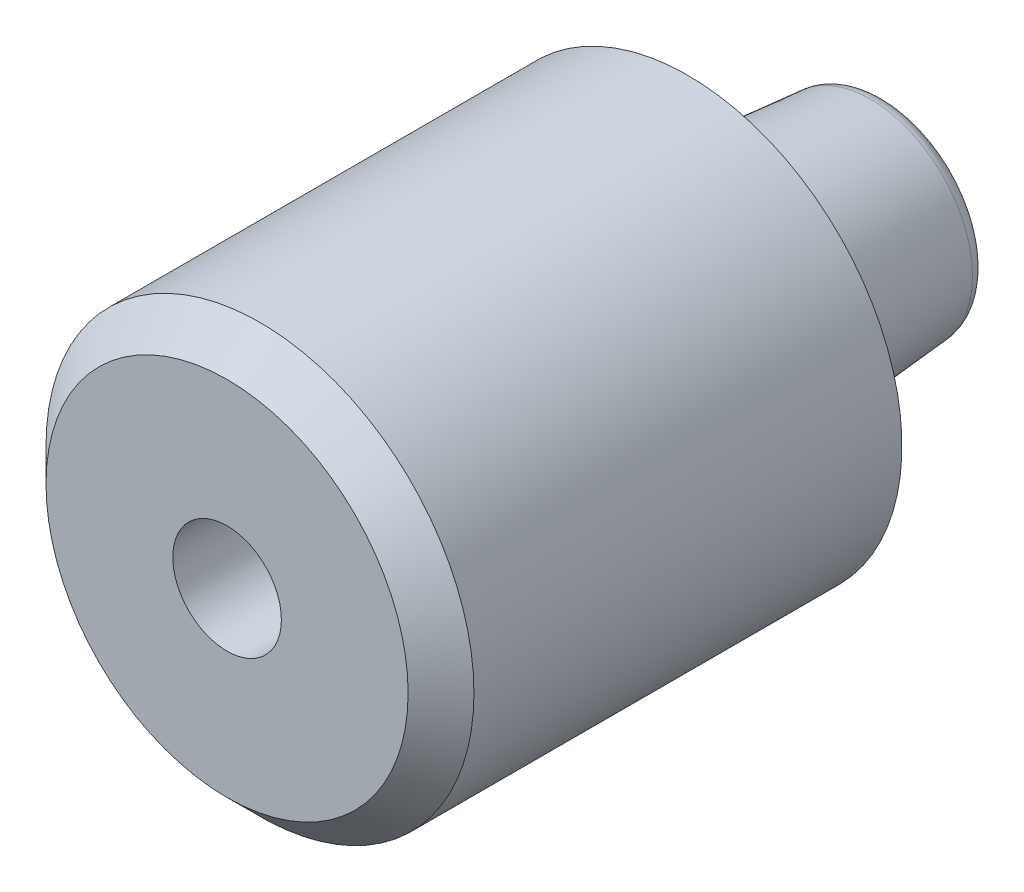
ISO-10303-21;
HEADER;
FILE_DESCRIPTION(('STEP AP214'),'2;1');
FILE_NAME('part.step','',(''),(''),'','','');
FILE_SCHEMA(('AUTOMOTIVE_DESIGN { 1 0 10303 214 1 1 1 1 }'));
ENDSEC;
DATA;
#1=APPLICATION_CONTEXT('core data for automotive mechanical design processes');
#2=APPLICATION_PROTOCOL_DEFINITION('international standard','automotive_design',2000,#1);
#3=PRODUCT_CONTEXT('',#1,'mechanical');
#4=PRODUCT('Part','Part','',(#3));
#5=PRODUCT_RELATED_PRODUCT_CATEGORY('part','',(#4));
#6=PRODUCT_DEFINITION_FORMATION('','',#4);
#7=PRODUCT_DEFINITION_CONTEXT('part definition',#1,'design');
#8=PRODUCT_DEFINITION('design','',#6,#7);
#9=PRODUCT_DEFINITION_SHAPE('','',#8);
#10=(LENGTH_UNIT() NAMED_UNIT(*) SI_UNIT(.MILLI.,.METRE.));
#11=(NAMED_UNIT(*) PLANE_ANGLE_UNIT() SI_UNIT($,.RADIAN.));
#12=(NAMED_UNIT(*) SI_UNIT($,.STERADIAN.) SOLID_ANGLE_UNIT());
#13=UNCERTAINTY_MEASURE_WITH_UNIT(LENGTH_MEASURE(1.E-05),#10,'distance_accuracy_value','');
#14=(GEOMETRIC_REPRESENTATION_CONTEXT(3) GLOBAL_UNCERTAINTY_ASSIGNED_CONTEXT((#13)) GLOBAL_UNIT_ASSIGNED_CONTEXT((#10,
#11,#12)) REPRESENTATION_CONTEXT('',''));
#15=CARTESIAN_POINT('',(0.,0.,0.));
#16=DIRECTION('',(0.,0.,1.));
#17=DIRECTION('',(1.,0.,0.));
#18=AXIS2_PLACEMENT_3D('',#15,#16,#17);
#19=CARTESIAN_POINT('',(0.,0.,11.3076118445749));
#20=DIRECTION('',(0.,0.,-1.));
#21=DIRECTION('',(1.,0.,0.));
#22=AXIS2_PLACEMENT_3D('',#19,#20,#21);
#23=CONICAL_SURFACE('',#22,9.19238815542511,0.785398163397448);
#24=CARTESIAN_POINT('',(1.04744440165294E-13,0.,15.));
#25=DIRECTION('',(0.,0.,-1.));
#26=DIRECTION('',(-1.,0.,0.));
#27=AXIS2_PLACEMENT_3D('',#24,#25,#26);
#28=CIRCLE('',#27,5.5);
#29=CARTESIAN_POINT('',(-5.4999999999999,0.,15.));
#30=VERTEX_POINT('',#29);
#31=CARTESIAN_POINT('',(5.50000000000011,0.,15.));
#32=VERTEX_POINT('',#31);
#33=EDGE_CURVE('E59',#30,#32,#28,.T.);
#34=ORIENTED_EDGE('',*,*,#33,.T.);
#35=CARTESIAN_POINT('',(5.50000026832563,0.,14.9999997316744));
#36=CARTESIAN_POINT('',(6.50000039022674,0.,13.9999996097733));
#37=B_SPLINE_CURVE_WITH_KNOTS('',1,(#35,#36),.UNSPECIFIED.,.F.,.F.,(2,2),(0.598321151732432,
0.707106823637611),.UNSPECIFIED.);
#38=CARTESIAN_POINT('',(6.5000000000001,0.,14.));
#39=VERTEX_POINT('',#38);
#40=EDGE_CURVE('E46',#32,#39,#37,.T.);
#41=ORIENTED_EDGE('',*,*,#40,.T.);
#42=CARTESIAN_POINT('',(0.,0.,14.));
#43=DIRECTION('',(0.,0.,1.));
#44=DIRECTION('',(-1.,0.,0.));
#45=AXIS2_PLACEMENT_3D('',#42,#43,#44);
#46=CIRCLE('',#45,6.5);
#47=CARTESIAN_POINT('',(-6.4999999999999,0.,14.));
#48=VERTEX_POINT('',#47);
#49=EDGE_CURVE('E97',#39,#48,#46,.T.);
#50=ORIENTED_EDGE('',*,*,#49,.T.);
#51=CARTESIAN_POINT('',(0.,0.,14.));
#52=DIRECTION('',(0.,0.,1.));
#53=DIRECTION('',(-1.,0.,0.));
#54=AXIS2_PLACEMENT_3D('',#51,#52,#53);
#55=CIRCLE('',#54,6.5);
#56=EDGE_CURVE('E11',#48,#39,#55,.T.);
#57=ORIENTED_EDGE('',*,*,#56,.T.);
#58=ORIENTED_EDGE('',*,*,#40,.F.);
#59=CARTESIAN_POINT('',(1.04744440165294E-13,0.,15.));
#60=DIRECTION('',(0.,0.,-1.));
#61=DIRECTION('',(-1.,0.,0.));
#62=AXIS2_PLACEMENT_3D('',#59,#60,#61);
#63=CIRCLE('',#62,5.5);
#64=EDGE_CURVE('E94',#32,#30,#63,.T.);
#65=ORIENTED_EDGE('',*,*,#64,.T.);
#66=EDGE_LOOP('',(#34,#41,#50,#57,#58,#65));
#67=FACE_BOUND('',#66,.T.);
#68=ADVANCED_FACE('F38',(#67),#23,.T.);
#69=CARTESIAN_POINT('',(0.,0.,8.));
#70=DIRECTION('',(0.,0.,-1.));
#71=DIRECTION('',(-1.,0.,0.));
#72=AXIS2_PLACEMENT_3D('',#69,#70,#71);
#73=CYLINDRICAL_SURFACE('',#72,6.5);
#74=ORIENTED_EDGE('',*,*,#49,.F.);
#75=ORIENTED_EDGE('',*,*,#56,.F.);
#76=CARTESIAN_POINT('',(-6.4999999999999,0.,13.9999990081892));
#77=CARTESIAN_POINT('',(-6.5,0.,0.999998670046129));
#78=B_SPLINE_CURVE_WITH_KNOTS('',1,(#76,#77),.UNSPECIFIED.,.F.,.F.,(2,2),(0.0833333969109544,
0.916666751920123),.UNSPECIFIED.);
#79=CARTESIAN_POINT('',(-6.5,0.,1.00000000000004));
#80=VERTEX_POINT('',#79);
#81=EDGE_CURVE('E132',#48,#80,#78,.T.);
#82=ORIENTED_EDGE('',*,*,#81,.T.);
#83=CARTESIAN_POINT('',(0.,0.,1.));
#84=DIRECTION('',(0.,0.,-1.));
#85=DIRECTION('',(-1.,0.,0.));
#86=AXIS2_PLACEMENT_3D('',#83,#84,#85);
#87=CIRCLE('',#86,6.5);
#88=EDGE_CURVE('E137',#80,#80,#87,.T.);
#89=ORIENTED_EDGE('',*,*,#88,.F.);
#90=ORIENTED_EDGE('',*,*,#81,.F.);
#91=EDGE_LOOP('',(#74,#75,#82,#89,#90));
#92=FACE_BOUND('',#91,.T.);
#93=ADVANCED_FACE('F182',(#92),#73,.T.);
#94=CARTESIAN_POINT('',(-7.1499999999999,-11.4315353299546,15.));
#95=DIRECTION('',(0.,0.,1.));
#96=DIRECTION('',(1.,0.,0.));
#97=AXIS2_PLACEMENT_3D('',#94,#95,#96);
#98=PLANE('',#97);
#99=CARTESIAN_POINT('',(0.,0.,15.));
#100=DIRECTION('',(0.,0.,1.));
#101=DIRECTION('',(1.,0.,0.));
#102=AXIS2_PLACEMENT_3D('',#99,#100,#101);
#103=CIRCLE('',#102,1.64999999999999);
#104=CARTESIAN_POINT('',(1.64999999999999,0.,15.));
#105=VERTEX_POINT('',#104);
#106=EDGE_CURVE('E95',#105,#105,#103,.T.);
#107=ORIENTED_EDGE('',*,*,#106,.F.);
#108=EDGE_LOOP('',(#107));
#109=FACE_BOUND('',#108,.T.);
#110=ORIENTED_EDGE('',*,*,#64,.F.);
#111=ORIENTED_EDGE('',*,*,#33,.F.);
#112=EDGE_LOOP('',(#110,#111));
#113=FACE_BOUND('',#112,.T.);
#114=ADVANCED_FACE('F185',(#109,#113),#98,.T.);
#115=CARTESIAN_POINT('',(0.,0.,-4.5));
#116=DIRECTION('',(0.,0.,-1.));
#117=DIRECTION('',(-1.,0.,0.));
#118=AXIS2_PLACEMENT_3D('',#115,#116,#117);
#119=TOROIDAL_SURFACE('',#118,2.60439109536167,0.5);
#120=CARTESIAN_POINT('',(0.,0.,-4.54357787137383));
#121=DIRECTION('',(0.,0.,-1.));
#122=DIRECTION('',(-1.,0.,0.));
#123=AXIS2_PLACEMENT_3D('',#120,#121,#122);
#124=CIRCLE('',#123,3.10248844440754);
#125=CARTESIAN_POINT('',(-3.10248844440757,0.,-4.54357787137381));
#126=VERTEX_POINT('',#125);
#127=EDGE_CURVE('E138',#126,#126,#124,.T.);
#128=ORIENTED_EDGE('',*,*,#127,.T.);
#129=CARTESIAN_POINT('',(-3.10248844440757,0.,-4.54357787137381));
#130=CARTESIAN_POINT('',(-3.06255668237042,0.,-4.99999999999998));
#131=CARTESIAN_POINT('',(-2.6043910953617,0.,-5.));
#132=(BOUNDED_CURVE() B_SPLINE_CURVE(2,(#129,#130,#131),.UNSPECIFIED.,.F.,
.F.) B_SPLINE_CURVE_WITH_KNOTS((3,3),(0.,0.5),
.UNSPECIFIED.) CURVE() GEOMETRIC_REPRESENTATION_ITEM() RATIONAL_B_SPLINE_CURVE((1.,
0.737277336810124,1.)) REPRESENTATION_ITEM(''));
#133=CARTESIAN_POINT('',(-2.6043910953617,0.,-5.));
#134=VERTEX_POINT('',#133);
#135=EDGE_CURVE('E121',#126,#134,#132,.T.);
#136=ORIENTED_EDGE('',*,*,#135,.T.);
#137=CARTESIAN_POINT('',(0.,0.,-5.));
#138=DIRECTION('',(0.,0.,1.));
#139=DIRECTION('',(-1.,0.,0.));
#140=AXIS2_PLACEMENT_3D('',#137,#138,#139);
#141=CIRCLE('',#140,2.60439109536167);
#142=EDGE_CURVE('E127',#134,#134,#141,.T.);
#143=ORIENTED_EDGE('',*,*,#142,.T.);
#144=ORIENTED_EDGE('',*,*,#135,.F.);
#145=EDGE_LOOP('',(#128,#136,#143,#144));
#146=FACE_BOUND('',#145,.T.);
#147=ADVANCED_FACE('F187',(#146),#119,.T.);
#148=CARTESIAN_POINT('',(0.,0.,0.));
#149=DIRECTION('',(0.,0.,1.));
#150=DIRECTION('',(-1.,0.,0.));
#151=AXIS2_PLACEMENT_3D('',#148,#149,#150);
#152=CONICAL_SURFACE('',#151,3.5,0.0872664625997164);
#153=ORIENTED_EDGE('',*,*,#127,.F.);
#154=CARTESIAN_POINT('',(-3.10248844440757,0.,-4.54357787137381));
#155=CARTESIAN_POINT('',(-3.5,0.,0.));
#156=B_SPLINE_CURVE_WITH_KNOTS('',1,(#154,#155),.UNSPECIFIED.,.F.,.F.,(2,2),(0.,1.),.UNSPECIFIED.);
#157=CARTESIAN_POINT('',(-3.5,0.,0.));
#158=VERTEX_POINT('',#157);
#159=EDGE_CURVE('E110',#126,#158,#156,.T.);
#160=ORIENTED_EDGE('',*,*,#159,.T.);
#161=CARTESIAN_POINT('',(0.,0.,0.));
#162=DIRECTION('',(0.,0.,-1.));
#163=DIRECTION('',(-1.,0.,0.));
#164=AXIS2_PLACEMENT_3D('',#161,#162,#163);
#165=CIRCLE('',#164,3.5);
#166=EDGE_CURVE('E116',#158,#158,#165,.T.);
#167=ORIENTED_EDGE('',*,*,#166,.T.);
#168=ORIENTED_EDGE('',*,*,#159,.F.);
#169=EDGE_LOOP('',(#153,#160,#167,#168));
#170=FACE_BOUND('',#169,.T.);
#171=ADVANCED_FACE('F194',(#170),#152,.T.);
#172=CARTESIAN_POINT('',(5.9900995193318,-5.41312523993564,-5.));
#173=DIRECTION('',(0.,0.,-1.));
#174=DIRECTION('',(-1.,0.,0.));
#175=AXIS2_PLACEMENT_3D('',#172,#173,#174);
#176=PLANE('',#175);
#177=ORIENTED_EDGE('',*,*,#142,.F.);
#178=EDGE_LOOP('',(#177));
#179=FACE_BOUND('',#178,.T.);
#180=ADVANCED_FACE('F222',(#179),#176,.T.);
#181=CARTESIAN_POINT('',(0.,0.,0.5));
#182=DIRECTION('',(0.,0.,-1.));
#183=DIRECTION('',(-1.,0.,0.));
#184=AXIS2_PLACEMENT_3D('',#181,#182,#183);
#185=CYLINDRICAL_SURFACE('',#184,3.5);
#186=CARTESIAN_POINT('',(0.,0.,1.));
#187=DIRECTION('',(0.,0.,1.));
#188=DIRECTION('',(-1.,0.,0.));
#189=AXIS2_PLACEMENT_3D('',#186,#187,#188);
#190=CIRCLE('',#189,3.5);
#191=CARTESIAN_POINT('',(-3.5,0.,1.00000000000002));
#192=VERTEX_POINT('',#191);
#193=EDGE_CURVE('E105',#192,#192,#190,.T.);
#194=ORIENTED_EDGE('',*,*,#193,.F.);
#195=CARTESIAN_POINT('',(-3.5,0.,1.00000305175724));
#196=CARTESIAN_POINT('',(-3.5,0.,5.31746900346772E-07));
#197=B_SPLINE_CURVE_WITH_KNOTS('',1,(#195,#196),.UNSPECIFIED.,.F.,.F.,(2,2),(0.0833307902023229,
0.91666622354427),.UNSPECIFIED.);
#198=EDGE_CURVE('E102',#192,#158,#197,.T.);
#199=ORIENTED_EDGE('',*,*,#198,.T.);
#200=ORIENTED_EDGE('',*,*,#166,.F.);
#201=ORIENTED_EDGE('',*,*,#198,.F.);
#202=EDGE_LOOP('',(#194,#199,#200,#201));
#203=FACE_BOUND('',#202,.T.);
#204=ADVANCED_FACE('F231',(#203),#185,.T.);
#205=CARTESIAN_POINT('',(14.95,-13.5099962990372,0.999999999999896));
#206=DIRECTION('',(0.,0.,-1.));
#207=DIRECTION('',(-1.,0.,0.));
#208=AXIS2_PLACEMENT_3D('',#205,#206,#207);
#209=PLANE('',#208);
#210=ORIENTED_EDGE('',*,*,#88,.T.);
#211=EDGE_LOOP('',(#210));
#212=FACE_BOUND('',#211,.T.);
#213=ORIENTED_EDGE('',*,*,#193,.T.);
#214=EDGE_LOOP('',(#213));
#215=FACE_BOUND('',#214,.T.);
#216=ADVANCED_FACE('F88',(#212,#215),#209,.T.);
#217=CARTESIAN_POINT('',(0.,0.,2.99999999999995));
#218=DIRECTION('',(0.,0.,1.));
#219=DIRECTION('',(1.,0.,0.));
#220=AXIS2_PLACEMENT_3D('',#217,#218,#219);
#221=CONICAL_SURFACE('',#220,1.65,1.02974425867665);
#222=CARTESIAN_POINT('',(0.,0.,2.00857997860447));
#223=VERTEX_POINT('',#222);
#224=VERTEX_LOOP('',#223);
#225=FACE_BOUND('',#224,.T.);
#226=CARTESIAN_POINT('',(0.,0.,2.99999999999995));
#227=DIRECTION('',(0.,0.,1.));
#228=DIRECTION('',(1.,0.,0.));
#229=AXIS2_PLACEMENT_3D('',#226,#227,#228);
#230=CIRCLE('',#229,1.65);
#231=CARTESIAN_POINT('',(1.65,0.,2.99999999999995));
#232=VERTEX_POINT('',#231);
#233=EDGE_CURVE('E92',#232,#232,#230,.T.);
#234=ORIENTED_EDGE('',*,*,#233,.T.);
#235=EDGE_LOOP('',(#234));
#236=FACE_BOUND('',#235,.T.);
#237=ADVANCED_FACE('F84',(#225,#236),#221,.F.);
#238=CARTESIAN_POINT('',(0.,0.,14.9999999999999));
#239=DIRECTION('',(0.,0.,1.));
#240=DIRECTION('',(1.,0.,0.));
#241=AXIS2_PLACEMENT_3D('',#238,#239,#240);
#242=CYLINDRICAL_SURFACE('',#241,1.64999999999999);
#243=ORIENTED_EDGE('',*,*,#233,.F.);
#244=EDGE_LOOP('',(#243));
#245=FACE_BOUND('',#244,.T.);
#246=ORIENTED_EDGE('',*,*,#106,.T.);
#247=EDGE_LOOP('',(#246));
#248=FACE_BOUND('',#247,.T.);
#249=ADVANCED_FACE('F87',(#245,#248),#242,.F.);
#250=CLOSED_SHELL('',(#68,#93,#114,#147,#171,#180,#204,#216,#237,#249));
#251=MANIFOLD_SOLID_BREP('B2',#250);
#252=ADVANCED_BREP_SHAPE_REPRESENTATION('',(#18,#251),#14);
#253=SHAPE_DEFINITION_REPRESENTATION(#9,#252);
ENDSEC;
END-ISO-10303-21;
